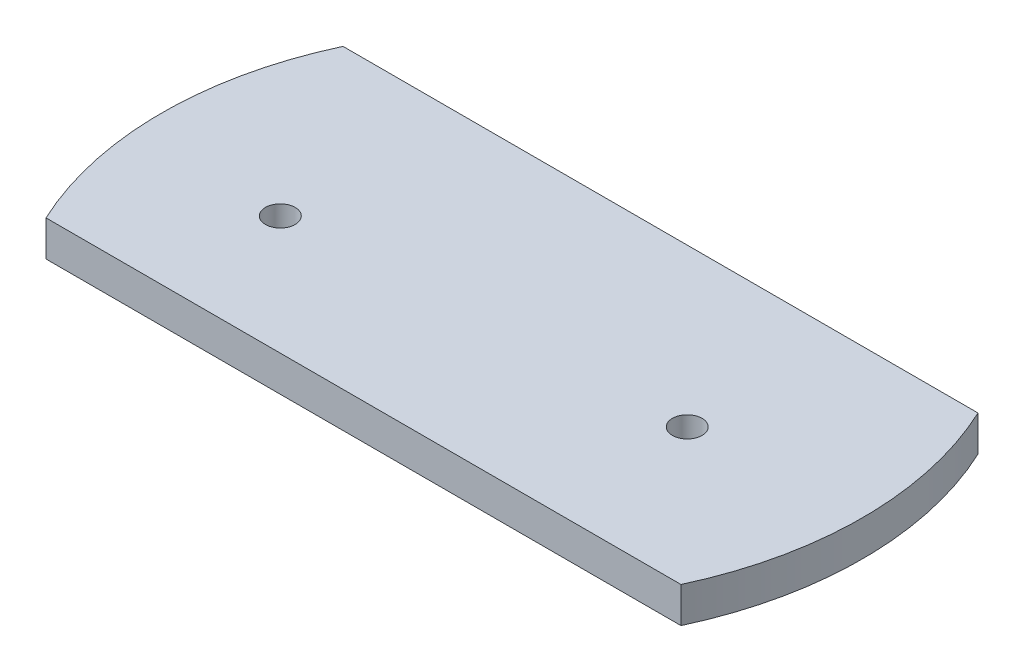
from build123d import *

# Parameters (mm, degrees)
EXTRUDE1_DEPTH    = 6
M6_TAPPED_HOLE1_D = 5


with BuildPart() as part:
    # Sketch1 → Extrude1 (new body)
    with BuildSketch(Plane(origin=(0, 0, 0), x_dir=(1, 0, 0), z_dir=(0, 1, 0))):
        with BuildLine():
            Line((5.558443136, 0), (112.441556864, 0))
            ThreePointArc((112.441556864, 0), (118, 25), (112.441556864, 50))
            Line((112.441556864, 50), (5.558443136, 50))
            ThreePointArc((5.558443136, 50), (0, 25), (5.558443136, 0))
        make_face()
    extrude(amount=EXTRUDE1_DEPTH)

    # M6 Tapped Hole1 (through all)
    with Locations(Plane(origin=(25, 6, -20), x_dir=(0, 0, 1), z_dir=(0, 1, 0))):
        with Locations((0, 0), (-3.5, 65)):
            Hole(M6_TAPPED_HOLE1_D / 2)


solid = part.part
